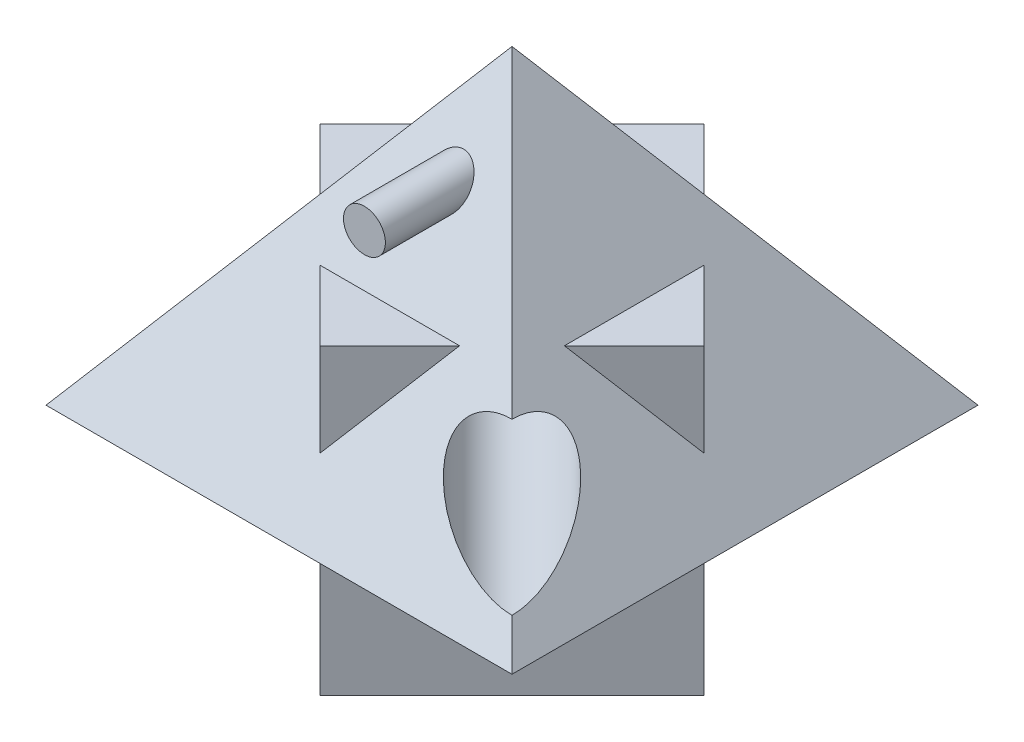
ISO-10303-21;
HEADER;
FILE_DESCRIPTION(('STEP AP214'),'2;1');
FILE_NAME('part.step','',(''),(''),'','','');
FILE_SCHEMA(('AUTOMOTIVE_DESIGN { 1 0 10303 214 1 1 1 1 }'));
ENDSEC;
DATA;
#1=APPLICATION_CONTEXT('core data for automotive mechanical design processes');
#2=APPLICATION_PROTOCOL_DEFINITION('international standard','automotive_design',2000,#1);
#3=PRODUCT_CONTEXT('',#1,'mechanical');
#4=PRODUCT('Part','Part','',(#3));
#5=PRODUCT_RELATED_PRODUCT_CATEGORY('part','',(#4));
#6=PRODUCT_DEFINITION_FORMATION('','',#4);
#7=PRODUCT_DEFINITION_CONTEXT('part definition',#1,'design');
#8=PRODUCT_DEFINITION('design','',#6,#7);
#9=PRODUCT_DEFINITION_SHAPE('','',#8);
#10=(LENGTH_UNIT() NAMED_UNIT(*) SI_UNIT(.MILLI.,.METRE.));
#11=(NAMED_UNIT(*) PLANE_ANGLE_UNIT() SI_UNIT($,.RADIAN.));
#12=(NAMED_UNIT(*) SI_UNIT($,.STERADIAN.) SOLID_ANGLE_UNIT());
#13=UNCERTAINTY_MEASURE_WITH_UNIT(LENGTH_MEASURE(1.E-05),#10,'distance_accuracy_value','');
#14=(GEOMETRIC_REPRESENTATION_CONTEXT(3) GLOBAL_UNCERTAINTY_ASSIGNED_CONTEXT((#13)) GLOBAL_UNIT_ASSIGNED_CONTEXT((#10,
#11,#12)) REPRESENTATION_CONTEXT('',''));
#15=CARTESIAN_POINT('',(0.,0.,0.));
#16=DIRECTION('',(0.,0.,1.));
#17=DIRECTION('',(1.,0.,0.));
#18=AXIS2_PLACEMENT_3D('',#15,#16,#17);
#19=CARTESIAN_POINT('',(0.,36.576,48.768));
#20=DIRECTION('',(0.,-0.6,-0.8));
#21=DIRECTION('',(0.,0.8,-0.6));
#22=AXIS2_PLACEMENT_3D('',#19,#20,#21);
#23=PLANE('',#22);
#24=DIRECTION('',(-0.514495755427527,0.685994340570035,-0.514495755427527));
#25=VECTOR('',#24,1.);
#26=CARTESIAN_POINT('',(76.2,0.,76.2));
#27=LINE('',#26,#25);
#28=CARTESIAN_POINT('',(76.2,0.,76.2));
#29=VERTEX_POINT('',#28);
#30=CARTESIAN_POINT('',(69.05625,9.52499999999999,69.05625));
#31=VERTEX_POINT('',#30);
#32=EDGE_CURVE('E196',#29,#31,#27,.T.);
#33=ORIENTED_EDGE('',*,*,#32,.T.);
#34=CARTESIAN_POINT('',(57.15,25.4,57.15));
#35=DIRECTION('',(0.,-0.6,-0.8));
#36=DIRECTION('',(0.857492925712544,-0.411596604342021,0.308697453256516));
#37=AXIS2_PLACEMENT_3D('',#34,#35,#36);
#38=ELLIPSE('',#37,28.0633003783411,15.875);
#39=CARTESIAN_POINT('',(45.24375,41.275,45.24375));
#40=VERTEX_POINT('',#39);
#41=EDGE_CURVE('E58',#31,#40,#38,.T.);
#42=ORIENTED_EDGE('',*,*,#41,.T.);
#43=CARTESIAN_POINT('',(0.,101.6,0.));
#44=VERTEX_POINT('',#43);
#45=EDGE_CURVE('E181',#40,#44,#27,.T.);
#46=ORIENTED_EDGE('',*,*,#45,.T.);
#47=DIRECTION('',(0.514495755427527,0.685994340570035,-0.514495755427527));
#48=VECTOR('',#47,1.);
#49=CARTESIAN_POINT('',(-76.2,0.,76.2));
#50=LINE('',#49,#48);
#51=CARTESIAN_POINT('',(-76.2,0.,76.2));
#52=VERTEX_POINT('',#51);
#53=EDGE_CURVE('E368',#52,#44,#50,.T.);
#54=ORIENTED_EDGE('',*,*,#53,.F.);
#55=DIRECTION('',(1.,0.,0.));
#56=VECTOR('',#55,1.);
#57=CARTESIAN_POINT('',(-76.2,0.,76.2));
#58=LINE('',#57,#56);
#59=EDGE_CURVE('E239',#52,#29,#58,.T.);
#60=ORIENTED_EDGE('',*,*,#59,.T.);
#61=EDGE_LOOP('',(#33,#42,#46,#54,#60));
#62=FACE_BOUND('',#61,.T.);
#63=DIRECTION('',(-0.514495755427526,-0.685994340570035,0.514495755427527));
#64=VECTOR('',#63,1.);
#65=CARTESIAN_POINT('',(10.3630829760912,31.6017201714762,52.4987098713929));
#66=LINE('',#65,#64);
#67=CARTESIAN_POINT('',(22.8567928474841,48.26,40.005));
#68=VERTEX_POINT('',#67);
#69=CARTESIAN_POINT('',(0.,17.7842762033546,62.8617928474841));
#70=VERTEX_POINT('',#69);
#71=EDGE_CURVE('E350',#68,#70,#66,.T.);
#72=ORIENTED_EDGE('',*,*,#71,.T.);
#73=DIRECTION('',(-0.514495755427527,0.685994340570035,-0.514495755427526));
#74=VECTOR('',#73,1.);
#75=CARTESIAN_POINT('',(-10.3630829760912,31.6017201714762,52.4987098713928));
#76=LINE('',#75,#74);
#77=CARTESIAN_POINT('',(-22.8567928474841,48.26,40.005));
#78=VERTEX_POINT('',#77);
#79=EDGE_CURVE('E356',#70,#78,#76,.T.);
#80=ORIENTED_EDGE('',*,*,#79,.T.);
#81=DIRECTION('',(1.,0.,0.));
#82=VECTOR('',#81,1.);
#83=CARTESIAN_POINT('',(0.,48.26,40.005));
#84=LINE('',#83,#82);
#85=EDGE_CURVE('E338',#78,#68,#84,.T.);
#86=ORIENTED_EDGE('',*,*,#85,.T.);
#87=EDGE_LOOP('',(#72,#80,#86));
#88=FACE_BOUND('',#87,.T.);
#89=CARTESIAN_POINT('',(0.,73.617399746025,20.9869501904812));
#90=DIRECTION('',(0.,-0.6,-0.8));
#91=DIRECTION('',(0.,0.8,-0.6));
#92=AXIS2_PLACEMENT_3D('',#89,#90,#91);
#93=ELLIPSE('',#92,8.56585620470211,6.85268496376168);
#94=CARTESIAN_POINT('',(0.,80.4700847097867,15.84743646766));
#95=VERTEX_POINT('',#94);
#96=EDGE_CURVE('E12',#95,#95,#93,.F.);
#97=ORIENTED_EDGE('',*,*,#96,.F.);
#98=EDGE_LOOP('',(#97));
#99=FACE_BOUND('',#98,.T.);
#100=ADVANCED_FACE('F43',(#62,#88,#99),#23,.F.);
#101=CARTESIAN_POINT('',(0.,0.,0.));
#102=DIRECTION('',(0.,-1.,0.));
#103=DIRECTION('',(0.,0.,-1.));
#104=AXIS2_PLACEMENT_3D('',#101,#102,#103);
#105=PLANE('',#104);
#106=DIRECTION('',(0.707106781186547,0.,-0.707106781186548));
#107=VECTOR('',#106,1.);
#108=CARTESIAN_POINT('',(-31.4308964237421,0.,-31.430896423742));
#109=LINE('',#108,#107);
#110=CARTESIAN_POINT('',(-62.8617928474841,0.,0.));
#111=VERTEX_POINT('',#110);
#112=CARTESIAN_POINT('',(0.,0.,-62.8617928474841));
#113=VERTEX_POINT('',#112);
#114=EDGE_CURVE('E347',#111,#113,#109,.T.);
#115=ORIENTED_EDGE('',*,*,#114,.F.);
#116=DIRECTION('',(-0.707106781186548,0.,-0.707106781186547));
#117=VECTOR('',#116,1.);
#118=CARTESIAN_POINT('',(-31.430896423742,0.,31.4308964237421));
#119=LINE('',#118,#117);
#120=CARTESIAN_POINT('',(0.,0.,62.8617928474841));
#121=VERTEX_POINT('',#120);
#122=EDGE_CURVE('E183',#121,#111,#119,.T.);
#123=ORIENTED_EDGE('',*,*,#122,.F.);
#124=DIRECTION('',(-0.707106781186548,0.,0.707106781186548));
#125=VECTOR('',#124,1.);
#126=CARTESIAN_POINT('',(31.4308964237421,0.,31.4308964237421));
#127=LINE('',#126,#125);
#128=CARTESIAN_POINT('',(62.8617928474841,0.,0.));
#129=VERTEX_POINT('',#128);
#130=EDGE_CURVE('E353',#129,#121,#127,.T.);
#131=ORIENTED_EDGE('',*,*,#130,.F.);
#132=DIRECTION('',(0.707106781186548,0.,0.707106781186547));
#133=VECTOR('',#132,1.);
#134=CARTESIAN_POINT('',(31.430896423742,0.,-31.4308964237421));
#135=LINE('',#134,#133);
#136=EDGE_CURVE('E343',#113,#129,#135,.T.);
#137=ORIENTED_EDGE('',*,*,#136,.F.);
#138=EDGE_LOOP('',(#115,#123,#131,#137));
#139=FACE_BOUND('',#138,.T.);
#140=DIRECTION('',(0.,0.,-1.));
#141=VECTOR('',#140,1.);
#142=CARTESIAN_POINT('',(76.2,0.,76.2));
#143=LINE('',#142,#141);
#144=CARTESIAN_POINT('',(76.2,0.,-76.2));
#145=VERTEX_POINT('',#144);
#146=EDGE_CURVE('E206',#29,#145,#143,.T.);
#147=ORIENTED_EDGE('',*,*,#146,.F.);
#148=ORIENTED_EDGE('',*,*,#59,.F.);
#149=DIRECTION('',(0.,0.,1.));
#150=VECTOR('',#149,1.);
#151=CARTESIAN_POINT('',(-76.2,0.,76.2));
#152=LINE('',#151,#150);
#153=CARTESIAN_POINT('',(-76.2,0.,-76.2));
#154=VERTEX_POINT('',#153);
#155=EDGE_CURVE('E244',#154,#52,#152,.T.);
#156=ORIENTED_EDGE('',*,*,#155,.F.);
#157=DIRECTION('',(-1.,0.,0.));
#158=VECTOR('',#157,1.);
#159=CARTESIAN_POINT('',(-76.2,0.,-76.2));
#160=LINE('',#159,#158);
#161=EDGE_CURVE('E176',#145,#154,#160,.T.);
#162=ORIENTED_EDGE('',*,*,#161,.F.);
#163=EDGE_LOOP('',(#147,#148,#156,#162));
#164=FACE_BOUND('',#163,.T.);
#165=ADVANCED_FACE('F223',(#139,#164),#105,.T.);
#166=CARTESIAN_POINT('',(-48.768,36.576,0.));
#167=DIRECTION('',(0.8,-0.6,0.));
#168=DIRECTION('',(0.6,0.8,0.));
#169=AXIS2_PLACEMENT_3D('',#166,#167,#168);
#170=PLANE('',#169);
#171=DIRECTION('',(-0.514495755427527,-0.685994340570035,-0.514495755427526));
#172=VECTOR('',#171,1.);
#173=CARTESIAN_POINT('',(-52.4987098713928,31.6017201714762,10.3630829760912));
#174=LINE('',#173,#172);
#175=CARTESIAN_POINT('',(-40.005,48.26,22.8567928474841));
#176=VERTEX_POINT('',#175);
#177=CARTESIAN_POINT('',(-62.8617928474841,17.7842762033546,0.));
#178=VERTEX_POINT('',#177);
#179=EDGE_CURVE('E162',#176,#178,#174,.T.);
#180=ORIENTED_EDGE('',*,*,#179,.T.);
#181=DIRECTION('',(0.514495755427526,0.685994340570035,-0.514495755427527));
#182=VECTOR('',#181,1.);
#183=CARTESIAN_POINT('',(-52.4987098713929,31.6017201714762,-10.3630829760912));
#184=LINE('',#183,#182);
#185=CARTESIAN_POINT('',(-40.005,48.26,-22.8567928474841));
#186=VERTEX_POINT('',#185);
#187=EDGE_CURVE('E306',#178,#186,#184,.T.);
#188=ORIENTED_EDGE('',*,*,#187,.T.);
#189=DIRECTION('',(0.,0.,1.));
#190=VECTOR('',#189,1.);
#191=CARTESIAN_POINT('',(-40.005,48.26,0.));
#192=LINE('',#191,#190);
#193=EDGE_CURVE('E307',#186,#176,#192,.T.);
#194=ORIENTED_EDGE('',*,*,#193,.T.);
#195=EDGE_LOOP('',(#180,#188,#194));
#196=FACE_BOUND('',#195,.T.);
#197=DIRECTION('',(0.514495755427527,0.685994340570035,0.514495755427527));
#198=VECTOR('',#197,1.);
#199=CARTESIAN_POINT('',(-76.2,0.,-76.2));
#200=LINE('',#199,#198);
#201=CARTESIAN_POINT('',(-45.24375,41.275,-45.24375));
#202=VERTEX_POINT('',#201);
#203=EDGE_CURVE('E170',#202,#44,#200,.T.);
#204=ORIENTED_EDGE('',*,*,#203,.F.);
#205=CARTESIAN_POINT('',(-57.15,25.4,-57.1499999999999));
#206=DIRECTION('',(0.8,-0.6,0.));
#207=DIRECTION('',(0.308697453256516,0.411596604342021,0.857492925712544));
#208=AXIS2_PLACEMENT_3D('',#205,#206,#207);
#209=ELLIPSE('',#208,28.0633003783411,15.875);
#210=CARTESIAN_POINT('',(-69.05625,9.525,-69.05625));
#211=VERTEX_POINT('',#210);
#212=EDGE_CURVE('E65',#202,#211,#209,.T.);
#213=ORIENTED_EDGE('',*,*,#212,.T.);
#214=EDGE_CURVE('E168',#154,#211,#200,.T.);
#215=ORIENTED_EDGE('',*,*,#214,.F.);
#216=ORIENTED_EDGE('',*,*,#155,.T.);
#217=ORIENTED_EDGE('',*,*,#53,.T.);
#218=EDGE_LOOP('',(#204,#213,#215,#216,#217));
#219=FACE_BOUND('',#218,.T.);
#220=ADVANCED_FACE('F166',(#196,#219),#170,.F.);
#221=CARTESIAN_POINT('',(48.768,36.576,0.));
#222=DIRECTION('',(-0.8,-0.6,0.));
#223=DIRECTION('',(0.6,-0.8,0.));
#224=AXIS2_PLACEMENT_3D('',#221,#222,#223);
#225=PLANE('',#224);
#226=DIRECTION('',(0.514495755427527,-0.685994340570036,0.514495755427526));
#227=VECTOR('',#226,1.);
#228=CARTESIAN_POINT('',(52.4987098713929,31.6017201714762,-10.3630829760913));
#229=LINE('',#228,#227);
#230=CARTESIAN_POINT('',(40.005,48.26,-22.8567928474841));
#231=VERTEX_POINT('',#230);
#232=CARTESIAN_POINT('',(62.8617928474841,17.7842762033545,0.));
#233=VERTEX_POINT('',#232);
#234=EDGE_CURVE('E341',#231,#233,#229,.T.);
#235=ORIENTED_EDGE('',*,*,#234,.T.);
#236=DIRECTION('',(-0.514495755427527,0.685994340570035,0.514495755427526));
#237=VECTOR('',#236,1.);
#238=CARTESIAN_POINT('',(52.4987098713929,31.6017201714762,10.3630829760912));
#239=LINE('',#238,#237);
#240=CARTESIAN_POINT('',(40.005,48.26,22.8567928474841));
#241=VERTEX_POINT('',#240);
#242=EDGE_CURVE('E298',#233,#241,#239,.T.);
#243=ORIENTED_EDGE('',*,*,#242,.T.);
#244=DIRECTION('',(0.,0.,-1.));
#245=VECTOR('',#244,1.);
#246=CARTESIAN_POINT('',(40.005,48.26,0.));
#247=LINE('',#246,#245);
#248=EDGE_CURVE('E317',#241,#231,#247,.T.);
#249=ORIENTED_EDGE('',*,*,#248,.T.);
#250=EDGE_LOOP('',(#235,#243,#249));
#251=FACE_BOUND('',#250,.T.);
#252=ORIENTED_EDGE('',*,*,#45,.F.);
#253=CARTESIAN_POINT('',(57.15,25.4,57.15));
#254=DIRECTION('',(-0.8,-0.6,0.));
#255=DIRECTION('',(0.308697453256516,-0.411596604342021,0.857492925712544));
#256=AXIS2_PLACEMENT_3D('',#253,#254,#255);
#257=ELLIPSE('',#256,28.0633003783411,15.875);
#258=EDGE_CURVE('E171',#40,#31,#257,.T.);
#259=ORIENTED_EDGE('',*,*,#258,.T.);
#260=ORIENTED_EDGE('',*,*,#32,.F.);
#261=ORIENTED_EDGE('',*,*,#146,.T.);
#262=DIRECTION('',(-0.514495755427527,0.685994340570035,0.514495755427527));
#263=VECTOR('',#262,1.);
#264=CARTESIAN_POINT('',(76.2,0.,-76.2));
#265=LINE('',#264,#263);
#266=EDGE_CURVE('E178',#145,#44,#265,.T.);
#267=ORIENTED_EDGE('',*,*,#266,.T.);
#268=EDGE_LOOP('',(#252,#259,#260,#261,#267));
#269=FACE_BOUND('',#268,.T.);
#270=ADVANCED_FACE('F210',(#251,#269),#225,.F.);
#271=CARTESIAN_POINT('',(0.,36.576,-48.768));
#272=DIRECTION('',(0.,-0.6,0.8));
#273=DIRECTION('',(0.,-0.8,-0.6));
#274=AXIS2_PLACEMENT_3D('',#271,#272,#273);
#275=PLANE('',#274);
#276=DIRECTION('',(-1.,0.,0.));
#277=VECTOR('',#276,1.);
#278=CARTESIAN_POINT('',(0.,48.26,-40.005));
#279=LINE('',#278,#277);
#280=CARTESIAN_POINT('',(22.8567928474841,48.26,-40.005));
#281=VERTEX_POINT('',#280);
#282=CARTESIAN_POINT('',(-22.8567928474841,48.26,-40.005));
#283=VERTEX_POINT('',#282);
#284=EDGE_CURVE('E243',#281,#283,#279,.T.);
#285=ORIENTED_EDGE('',*,*,#284,.T.);
#286=DIRECTION('',(0.514495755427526,-0.685994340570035,-0.514495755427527));
#287=VECTOR('',#286,1.);
#288=CARTESIAN_POINT('',(-10.3630829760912,31.6017201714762,-52.4987098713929));
#289=LINE('',#288,#287);
#290=CARTESIAN_POINT('',(0.,17.7842762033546,-62.8617928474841));
#291=VERTEX_POINT('',#290);
#292=EDGE_CURVE('E296',#283,#291,#289,.T.);
#293=ORIENTED_EDGE('',*,*,#292,.T.);
#294=DIRECTION('',(0.514495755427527,0.685994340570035,0.514495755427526));
#295=VECTOR('',#294,1.);
#296=CARTESIAN_POINT('',(10.3630829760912,31.6017201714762,-52.4987098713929));
#297=LINE('',#296,#295);
#298=EDGE_CURVE('E293',#291,#281,#297,.T.);
#299=ORIENTED_EDGE('',*,*,#298,.T.);
#300=EDGE_LOOP('',(#285,#293,#299));
#301=FACE_BOUND('',#300,.T.);
#302=ORIENTED_EDGE('',*,*,#214,.T.);
#303=CARTESIAN_POINT('',(-57.15,25.4,-57.15));
#304=DIRECTION('',(0.,-0.6,0.8));
#305=DIRECTION('',(0.857492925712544,0.411596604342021,0.308697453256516));
#306=AXIS2_PLACEMENT_3D('',#303,#304,#305);
#307=ELLIPSE('',#306,28.0633003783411,15.875);
#308=EDGE_CURVE('E52',#211,#202,#307,.T.);
#309=ORIENTED_EDGE('',*,*,#308,.T.);
#310=ORIENTED_EDGE('',*,*,#203,.T.);
#311=ORIENTED_EDGE('',*,*,#266,.F.);
#312=ORIENTED_EDGE('',*,*,#161,.T.);
#313=EDGE_LOOP('',(#302,#309,#310,#311,#312));
#314=FACE_BOUND('',#313,.T.);
#315=ADVANCED_FACE('F45',(#301,#314),#275,.F.);
#316=CARTESIAN_POINT('',(0.,48.26,0.));
#317=DIRECTION('',(0.,1.,0.));
#318=DIRECTION('',(0.,0.,1.));
#319=AXIS2_PLACEMENT_3D('',#316,#317,#318);
#320=PLANE('',#319);
#321=ORIENTED_EDGE('',*,*,#284,.F.);
#322=DIRECTION('',(0.707106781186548,0.,0.707106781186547));
#323=VECTOR('',#322,1.);
#324=CARTESIAN_POINT('',(0.,48.26,-62.8617928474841));
#325=LINE('',#324,#323);
#326=CARTESIAN_POINT('',(0.,48.26,-62.8617928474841));
#327=VERTEX_POINT('',#326);
#328=EDGE_CURVE('E386',#327,#281,#325,.T.);
#329=ORIENTED_EDGE('',*,*,#328,.F.);
#330=DIRECTION('',(0.707106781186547,0.,-0.707106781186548));
#331=VECTOR('',#330,1.);
#332=CARTESIAN_POINT('',(0.,48.26,-62.8617928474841));
#333=LINE('',#332,#331);
#334=EDGE_CURVE('E385',#283,#327,#333,.T.);
#335=ORIENTED_EDGE('',*,*,#334,.F.);
#336=EDGE_LOOP('',(#321,#329,#335));
#337=FACE_BOUND('',#336,.T.);
#338=ADVANCED_FACE('F414',(#337),#320,.T.);
#339=CARTESIAN_POINT('',(0.,48.26,-62.8617928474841));
#340=DIRECTION('',(0.707106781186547,0.,-0.707106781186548));
#341=DIRECTION('',(-0.707106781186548,0.,-0.707106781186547));
#342=AXIS2_PLACEMENT_3D('',#339,#340,#341);
#343=PLANE('',#342);
#344=ORIENTED_EDGE('',*,*,#298,.F.);
#345=DIRECTION('',(0.,-1.,0.));
#346=VECTOR('',#345,1.);
#347=CARTESIAN_POINT('',(0.,48.26,-62.8617928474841));
#348=LINE('',#347,#346);
#349=EDGE_CURVE('E333',#327,#291,#348,.T.);
#350=ORIENTED_EDGE('',*,*,#349,.F.);
#351=ORIENTED_EDGE('',*,*,#328,.T.);
#352=EDGE_LOOP('',(#344,#350,#351));
#353=FACE_BOUND('',#352,.T.);
#354=ADVANCED_FACE('F413',(#353),#343,.T.);
#355=CARTESIAN_POINT('',(0.,48.26,-62.8617928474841));
#356=DIRECTION('',(-0.707106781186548,0.,-0.707106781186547));
#357=DIRECTION('',(-0.707106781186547,0.,0.707106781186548));
#358=AXIS2_PLACEMENT_3D('',#355,#356,#357);
#359=PLANE('',#358);
#360=ORIENTED_EDGE('',*,*,#292,.F.);
#361=ORIENTED_EDGE('',*,*,#334,.T.);
#362=ORIENTED_EDGE('',*,*,#349,.T.);
#363=EDGE_LOOP('',(#360,#361,#362));
#364=FACE_BOUND('',#363,.T.);
#365=ADVANCED_FACE('F409',(#364),#359,.T.);
#366=ORIENTED_EDGE('',*,*,#248,.F.);
#367=DIRECTION('',(-0.707106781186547,0.,0.707106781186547));
#368=VECTOR('',#367,1.);
#369=CARTESIAN_POINT('',(62.8617928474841,48.26,0.));
#370=LINE('',#369,#368);
#371=CARTESIAN_POINT('',(62.8617928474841,48.26,0.));
#372=VERTEX_POINT('',#371);
#373=EDGE_CURVE('E390',#372,#241,#370,.T.);
#374=ORIENTED_EDGE('',*,*,#373,.F.);
#375=EDGE_CURVE('E384',#231,#372,#325,.T.);
#376=ORIENTED_EDGE('',*,*,#375,.F.);
#377=EDGE_LOOP('',(#366,#374,#376));
#378=FACE_BOUND('',#377,.T.);
#379=ADVANCED_FACE('F422',(#378),#320,.T.);
#380=ORIENTED_EDGE('',*,*,#234,.F.);
#381=ORIENTED_EDGE('',*,*,#375,.T.);
#382=DIRECTION('',(0.,-1.,0.));
#383=VECTOR('',#382,1.);
#384=CARTESIAN_POINT('',(62.8617928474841,48.26,0.));
#385=LINE('',#384,#383);
#386=EDGE_CURVE('E329',#372,#233,#385,.T.);
#387=ORIENTED_EDGE('',*,*,#386,.T.);
#388=EDGE_LOOP('',(#380,#381,#387));
#389=FACE_BOUND('',#388,.T.);
#390=ADVANCED_FACE('F505',(#389),#343,.T.);
#391=CARTESIAN_POINT('',(62.8617928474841,48.26,0.));
#392=DIRECTION('',(0.707106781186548,0.,0.707106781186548));
#393=DIRECTION('',(0.707106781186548,0.,-0.707106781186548));
#394=AXIS2_PLACEMENT_3D('',#391,#392,#393);
#395=PLANE('',#394);
#396=ORIENTED_EDGE('',*,*,#242,.F.);
#397=ORIENTED_EDGE('',*,*,#386,.F.);
#398=ORIENTED_EDGE('',*,*,#373,.T.);
#399=EDGE_LOOP('',(#396,#397,#398));
#400=FACE_BOUND('',#399,.T.);
#401=ADVANCED_FACE('F503',(#400),#395,.T.);
#402=ORIENTED_EDGE('',*,*,#193,.F.);
#403=CARTESIAN_POINT('',(-62.8617928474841,48.26,0.));
#404=VERTEX_POINT('',#403);
#405=EDGE_CURVE('E382',#404,#186,#333,.T.);
#406=ORIENTED_EDGE('',*,*,#405,.F.);
#407=DIRECTION('',(-0.707106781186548,0.,-0.707106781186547));
#408=VECTOR('',#407,1.);
#409=CARTESIAN_POINT('',(-62.8617928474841,48.26,0.));
#410=LINE('',#409,#408);
#411=EDGE_CURVE('E311',#176,#404,#410,.T.);
#412=ORIENTED_EDGE('',*,*,#411,.F.);
#413=EDGE_LOOP('',(#402,#406,#412));
#414=FACE_BOUND('',#413,.T.);
#415=ADVANCED_FACE('F492',(#414),#320,.T.);
#416=CARTESIAN_POINT('',(-62.8617928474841,48.26,0.));
#417=DIRECTION('',(-0.707106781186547,0.,0.707106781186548));
#418=DIRECTION('',(0.707106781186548,0.,0.707106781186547));
#419=AXIS2_PLACEMENT_3D('',#416,#417,#418);
#420=PLANE('',#419);
#421=ORIENTED_EDGE('',*,*,#179,.F.);
#422=ORIENTED_EDGE('',*,*,#411,.T.);
#423=DIRECTION('',(0.,-1.,0.));
#424=VECTOR('',#423,1.);
#425=CARTESIAN_POINT('',(-62.8617928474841,48.26,0.));
#426=LINE('',#425,#424);
#427=EDGE_CURVE('E313',#404,#178,#426,.T.);
#428=ORIENTED_EDGE('',*,*,#427,.T.);
#429=EDGE_LOOP('',(#421,#422,#428));
#430=FACE_BOUND('',#429,.T.);
#431=ADVANCED_FACE('F310',(#430),#420,.T.);
#432=ORIENTED_EDGE('',*,*,#187,.F.);
#433=ORIENTED_EDGE('',*,*,#427,.F.);
#434=ORIENTED_EDGE('',*,*,#405,.T.);
#435=EDGE_LOOP('',(#432,#433,#434));
#436=FACE_BOUND('',#435,.T.);
#437=ADVANCED_FACE('F490',(#436),#359,.T.);
#438=ORIENTED_EDGE('',*,*,#85,.F.);
#439=CARTESIAN_POINT('',(0.,48.26,62.8617928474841));
#440=VERTEX_POINT('',#439);
#441=EDGE_CURVE('E393',#440,#78,#410,.T.);
#442=ORIENTED_EDGE('',*,*,#441,.F.);
#443=EDGE_CURVE('E389',#68,#440,#370,.T.);
#444=ORIENTED_EDGE('',*,*,#443,.F.);
#445=EDGE_LOOP('',(#438,#442,#444));
#446=FACE_BOUND('',#445,.T.);
#447=ADVANCED_FACE('F421',(#446),#320,.T.);
#448=ORIENTED_EDGE('',*,*,#71,.F.);
#449=ORIENTED_EDGE('',*,*,#443,.T.);
#450=DIRECTION('',(0.,-1.,0.));
#451=VECTOR('',#450,1.);
#452=CARTESIAN_POINT('',(0.,48.26,62.8617928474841));
#453=LINE('',#452,#451);
#454=EDGE_CURVE('E321',#440,#70,#453,.T.);
#455=ORIENTED_EDGE('',*,*,#454,.T.);
#456=EDGE_LOOP('',(#448,#449,#455));
#457=FACE_BOUND('',#456,.T.);
#458=ADVANCED_FACE('F489',(#457),#395,.T.);
#459=ORIENTED_EDGE('',*,*,#79,.F.);
#460=ORIENTED_EDGE('',*,*,#454,.F.);
#461=ORIENTED_EDGE('',*,*,#441,.T.);
#462=EDGE_LOOP('',(#459,#460,#461));
#463=FACE_BOUND('',#462,.T.);
#464=ADVANCED_FACE('F500',(#463),#420,.T.);
#465=CARTESIAN_POINT('',(-62.8617928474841,-50.8,0.));
#466=VERTEX_POINT('',#465);
#467=EDGE_CURVE('E318',#111,#466,#426,.T.);
#468=ORIENTED_EDGE('',*,*,#467,.F.);
#469=ORIENTED_EDGE('',*,*,#114,.T.);
#470=CARTESIAN_POINT('',(0.,-50.8,-62.8617928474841));
#471=VERTEX_POINT('',#470);
#472=EDGE_CURVE('E335',#113,#471,#348,.T.);
#473=ORIENTED_EDGE('',*,*,#472,.T.);
#474=DIRECTION('',(0.707106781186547,0.,-0.707106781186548));
#475=VECTOR('',#474,1.);
#476=CARTESIAN_POINT('',(0.,-50.8,-62.8617928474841));
#477=LINE('',#476,#475);
#478=EDGE_CURVE('E378',#466,#471,#477,.T.);
#479=ORIENTED_EDGE('',*,*,#478,.F.);
#480=EDGE_LOOP('',(#468,#469,#473,#479));
#481=FACE_BOUND('',#480,.T.);
#482=ADVANCED_FACE('F263',(#481),#359,.T.);
#483=CARTESIAN_POINT('',(0.,-50.8,62.8617928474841));
#484=VERTEX_POINT('',#483);
#485=EDGE_CURVE('E328',#121,#484,#453,.T.);
#486=ORIENTED_EDGE('',*,*,#485,.F.);
#487=ORIENTED_EDGE('',*,*,#122,.T.);
#488=ORIENTED_EDGE('',*,*,#467,.T.);
#489=DIRECTION('',(-0.707106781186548,0.,-0.707106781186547));
#490=VECTOR('',#489,1.);
#491=CARTESIAN_POINT('',(-62.8617928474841,-50.8,0.));
#492=LINE('',#491,#490);
#493=EDGE_CURVE('E324',#484,#466,#492,.T.);
#494=ORIENTED_EDGE('',*,*,#493,.F.);
#495=EDGE_LOOP('',(#486,#487,#488,#494));
#496=FACE_BOUND('',#495,.T.);
#497=ADVANCED_FACE('F495',(#496),#420,.T.);
#498=CARTESIAN_POINT('',(62.8617928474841,-50.8,0.));
#499=VERTEX_POINT('',#498);
#500=EDGE_CURVE('E332',#129,#499,#385,.T.);
#501=ORIENTED_EDGE('',*,*,#500,.F.);
#502=ORIENTED_EDGE('',*,*,#130,.T.);
#503=ORIENTED_EDGE('',*,*,#485,.T.);
#504=DIRECTION('',(-0.707106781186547,0.,0.707106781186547));
#505=VECTOR('',#504,1.);
#506=CARTESIAN_POINT('',(62.8617928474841,-50.8,0.));
#507=LINE('',#506,#505);
#508=EDGE_CURVE('E400',#499,#484,#507,.T.);
#509=ORIENTED_EDGE('',*,*,#508,.F.);
#510=EDGE_LOOP('',(#501,#502,#503,#509));
#511=FACE_BOUND('',#510,.T.);
#512=ADVANCED_FACE('F498',(#511),#395,.T.);
#513=ORIENTED_EDGE('',*,*,#472,.F.);
#514=ORIENTED_EDGE('',*,*,#136,.T.);
#515=ORIENTED_EDGE('',*,*,#500,.T.);
#516=DIRECTION('',(0.707106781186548,0.,0.707106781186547));
#517=VECTOR('',#516,1.);
#518=CARTESIAN_POINT('',(0.,-50.8,-62.8617928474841));
#519=LINE('',#518,#517);
#520=EDGE_CURVE('E398',#471,#499,#519,.T.);
#521=ORIENTED_EDGE('',*,*,#520,.F.);
#522=EDGE_LOOP('',(#513,#514,#515,#521));
#523=FACE_BOUND('',#522,.T.);
#524=ADVANCED_FACE('F494',(#523),#343,.T.);
#525=CARTESIAN_POINT('',(0.,-50.8,0.));
#526=DIRECTION('',(0.,1.,0.));
#527=DIRECTION('',(0.,0.,1.));
#528=AXIS2_PLACEMENT_3D('',#525,#526,#527);
#529=PLANE('',#528);
#530=ORIENTED_EDGE('',*,*,#478,.T.);
#531=ORIENTED_EDGE('',*,*,#520,.T.);
#532=ORIENTED_EDGE('',*,*,#508,.T.);
#533=ORIENTED_EDGE('',*,*,#493,.T.);
#534=EDGE_LOOP('',(#530,#531,#532,#533));
#535=FACE_BOUND('',#534,.T.);
#536=ADVANCED_FACE('F456',(#535),#529,.F.);
#537=CARTESIAN_POINT('',(-76.2001000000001,25.4,-76.2001));
#538=DIRECTION('',(0.707106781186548,0.,0.707106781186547));
#539=DIRECTION('',(0.707106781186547,0.,-0.707106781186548));
#540=AXIS2_PLACEMENT_3D('',#537,#538,#539);
#541=CYLINDRICAL_SURFACE('',#540,15.875);
#542=ORIENTED_EDGE('',*,*,#308,.F.);
#543=ORIENTED_EDGE('',*,*,#212,.F.);
#544=EDGE_LOOP('',(#542,#543));
#545=FACE_BOUND('',#544,.T.);
#546=ORIENTED_EDGE('',*,*,#258,.F.);
#547=ORIENTED_EDGE('',*,*,#41,.F.);
#548=EDGE_LOOP('',(#546,#547));
#549=FACE_BOUND('',#548,.T.);
#550=ADVANCED_FACE('F157',(#545,#549),#541,.F.);
#551=CARTESIAN_POINT('',(0.,73.617399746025,48.26));
#552=DIRECTION('',(0.,0.,-1.));
#553=DIRECTION('',(-1.,0.,0.));
#554=AXIS2_PLACEMENT_3D('',#551,#552,#553);
#555=CYLINDRICAL_SURFACE('',#554,6.85268496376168);
#556=CARTESIAN_POINT('',(0.,73.617399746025,48.26));
#557=DIRECTION('',(0.,0.,1.));
#558=DIRECTION('',(1.,0.,0.));
#559=AXIS2_PLACEMENT_3D('',#556,#557,#558);
#560=CIRCLE('',#559,6.85268496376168);
#561=CARTESIAN_POINT('',(6.85268496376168,73.617399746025,48.26));
#562=VERTEX_POINT('',#561);
#563=EDGE_CURVE('E172',#562,#562,#560,.T.);
#564=ORIENTED_EDGE('',*,*,#563,.F.);
#565=EDGE_LOOP('',(#564));
#566=FACE_BOUND('',#565,.T.);
#567=ORIENTED_EDGE('',*,*,#96,.T.);
#568=EDGE_LOOP('',(#567));
#569=FACE_BOUND('',#568,.T.);
#570=ADVANCED_FACE('F455',(#566,#569),#555,.T.);
#571=CARTESIAN_POINT('',(0.,73.617399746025,48.26));
#572=DIRECTION('',(0.,0.,1.));
#573=DIRECTION('',(1.,0.,0.));
#574=AXIS2_PLACEMENT_3D('',#571,#572,#573);
#575=PLANE('',#574);
#576=ORIENTED_EDGE('',*,*,#563,.T.);
#577=EDGE_LOOP('',(#576));
#578=FACE_BOUND('',#577,.T.);
#579=ADVANCED_FACE('F469',(#578),#575,.T.);
#580=CLOSED_SHELL('',(#100,#165,#220,#270,#315,#338,#354,#365,#379,#390,#401,#415,#431,#437,
#447,#458,#464,#482,#497,#512,#524,#536,#550,#570,#579));
#581=MANIFOLD_SOLID_BREP('B2',#580);
#582=ADVANCED_BREP_SHAPE_REPRESENTATION('',(#18,#581),#14);
#583=SHAPE_DEFINITION_REPRESENTATION(#9,#582);
ENDSEC;
END-ISO-10303-21;
